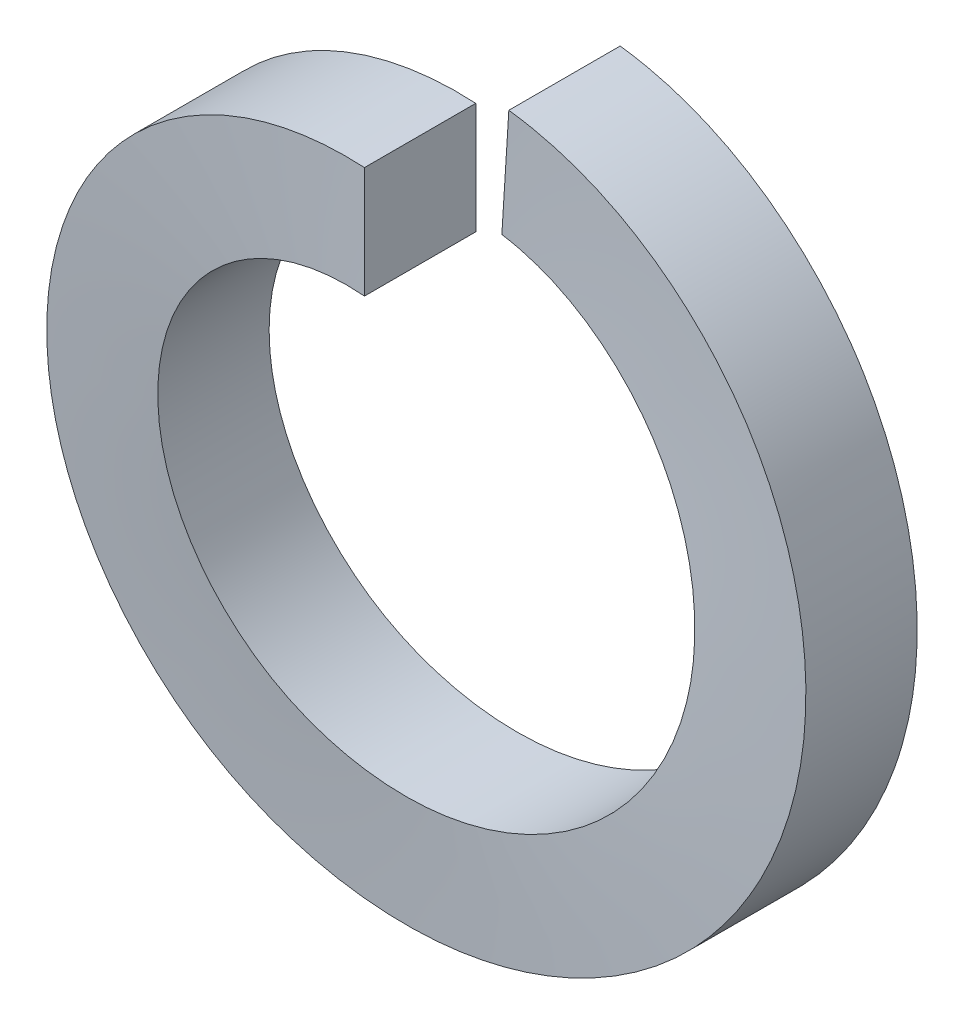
from build123d import *

# Parameters (mm, degrees)
SWEEP1_PITCH       = 1.326444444
SWEEP1_HEIGHT      = 1.31318
SWEEP1_RADIUS      = 3.7338
SWEEP1_START_ANGLE = 90
SKETCH2_W          = 1.1938
SKETCH2_H          = 1.1938


with BuildPart() as part:
    # Sweep1: sweep along a helix
    with BuildLine() as sweep1_path:
        add(Helix(SWEEP1_PITCH, SWEEP1_HEIGHT, SWEEP1_RADIUS, center=(0, 0, 0), direction=(0, 0, -1), lefthand=True, mode=Mode.PRIVATE).rotate(Axis((0, 0, 0), (0, 0, -1)), SWEEP1_START_ANGLE))
    # Sketch2 → Sweep1 (sweep)
    with BuildSketch(Plane(origin=(0, 0, 0), x_dir=(0, 0, -1), z_dir=(1, 0, 0))):
        with Locations((-0.5969, 3.1369)):
            Rectangle(SKETCH2_W, SKETCH2_H)
    sweep(path=sweep1_path.line, is_frenet=True)


solid = part.part
